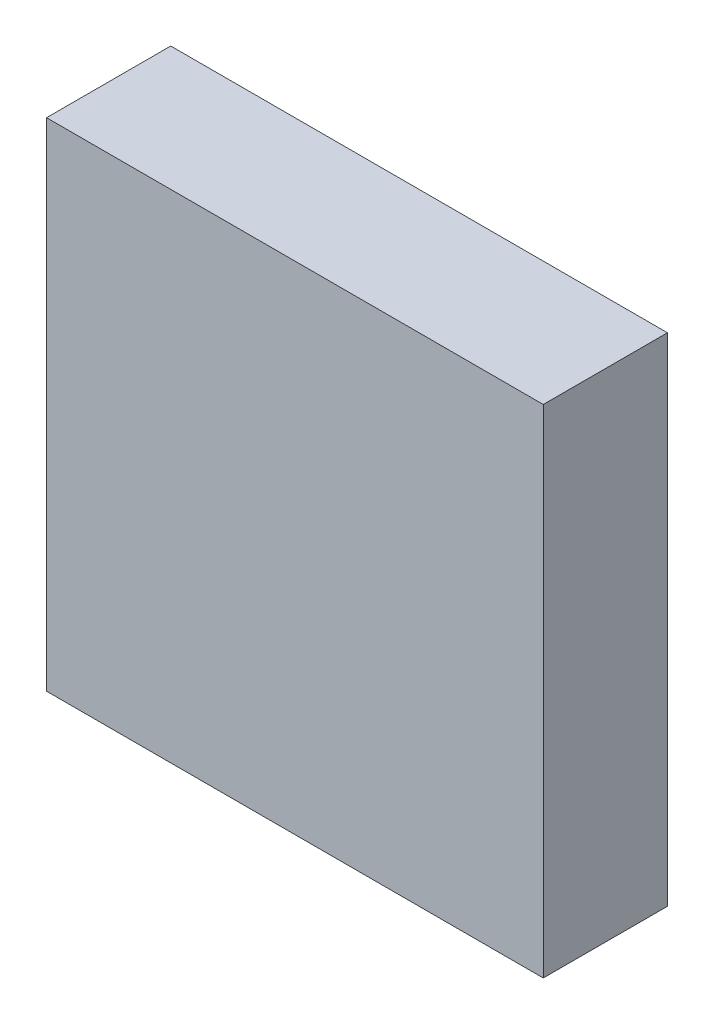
ISO-10303-21;
HEADER;
FILE_DESCRIPTION(('STEP AP214'),'2;1');
FILE_NAME('part.step','',(''),(''),'','','');
FILE_SCHEMA(('AUTOMOTIVE_DESIGN { 1 0 10303 214 1 1 1 1 }'));
ENDSEC;
DATA;
#1=APPLICATION_CONTEXT('core data for automotive mechanical design processes');
#2=APPLICATION_PROTOCOL_DEFINITION('international standard','automotive_design',2000,#1);
#3=PRODUCT_CONTEXT('',#1,'mechanical');
#4=PRODUCT('Part','Part','',(#3));
#5=PRODUCT_RELATED_PRODUCT_CATEGORY('part','',(#4));
#6=PRODUCT_DEFINITION_FORMATION('','',#4);
#7=PRODUCT_DEFINITION_CONTEXT('part definition',#1,'design');
#8=PRODUCT_DEFINITION('design','',#6,#7);
#9=PRODUCT_DEFINITION_SHAPE('','',#8);
#10=(LENGTH_UNIT() NAMED_UNIT(*) SI_UNIT(.MILLI.,.METRE.));
#11=(NAMED_UNIT(*) PLANE_ANGLE_UNIT() SI_UNIT($,.RADIAN.));
#12=(NAMED_UNIT(*) SI_UNIT($,.STERADIAN.) SOLID_ANGLE_UNIT());
#13=UNCERTAINTY_MEASURE_WITH_UNIT(LENGTH_MEASURE(1.E-05),#10,'distance_accuracy_value','');
#14=(GEOMETRIC_REPRESENTATION_CONTEXT(3) GLOBAL_UNCERTAINTY_ASSIGNED_CONTEXT((#13)) GLOBAL_UNIT_ASSIGNED_CONTEXT((#10,
#11,#12)) REPRESENTATION_CONTEXT('',''));
#15=CARTESIAN_POINT('',(0.,0.,0.));
#16=DIRECTION('',(0.,0.,1.));
#17=DIRECTION('',(1.,0.,0.));
#18=AXIS2_PLACEMENT_3D('',#15,#16,#17);
#19=CARTESIAN_POINT('',(-216.479833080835,582.885057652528,200.));
#20=DIRECTION('',(1.,0.,0.));
#21=DIRECTION('',(0.,0.,-1.));
#22=AXIS2_PLACEMENT_3D('',#19,#20,#21);
#23=PLANE('',#22);
#24=DIRECTION('',(0.,-1.,0.));
#25=VECTOR('',#24,1.);
#26=CARTESIAN_POINT('',(-216.479833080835,582.885057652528,0.));
#27=LINE('',#26,#25);
#28=CARTESIAN_POINT('',(-216.479833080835,582.885057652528,0.));
#29=VERTEX_POINT('',#28);
#30=CARTESIAN_POINT('',(-216.479833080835,-217.114942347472,0.));
#31=VERTEX_POINT('',#30);
#32=EDGE_CURVE('E96',#29,#31,#27,.T.);
#33=ORIENTED_EDGE('',*,*,#32,.T.);
#34=DIRECTION('',(0.,0.,-1.));
#35=VECTOR('',#34,1.);
#36=CARTESIAN_POINT('',(-216.479833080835,-217.114942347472,200.));
#37=LINE('',#36,#35);
#38=CARTESIAN_POINT('',(-216.479833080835,-217.114942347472,200.));
#39=VERTEX_POINT('',#38);
#40=EDGE_CURVE('E11',#39,#31,#37,.T.);
#41=ORIENTED_EDGE('',*,*,#40,.F.);
#42=DIRECTION('',(0.,-1.,0.));
#43=VECTOR('',#42,1.);
#44=CARTESIAN_POINT('',(-216.479833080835,582.885057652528,200.));
#45=LINE('',#44,#43);
#46=CARTESIAN_POINT('',(-216.479833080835,582.885057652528,200.));
#47=VERTEX_POINT('',#46);
#48=EDGE_CURVE('E84',#47,#39,#45,.T.);
#49=ORIENTED_EDGE('',*,*,#48,.F.);
#50=DIRECTION('',(0.,0.,-1.));
#51=VECTOR('',#50,1.);
#52=CARTESIAN_POINT('',(-216.479833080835,582.885057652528,200.));
#53=LINE('',#52,#51);
#54=EDGE_CURVE('E92',#47,#29,#53,.T.);
#55=ORIENTED_EDGE('',*,*,#54,.T.);
#56=EDGE_LOOP('',(#33,#41,#49,#55));
#57=FACE_BOUND('',#56,.T.);
#58=ADVANCED_FACE('F33',(#57),#23,.F.);
#59=CARTESIAN_POINT('',(-216.479833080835,-217.114942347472,200.));
#60=DIRECTION('',(0.,1.,0.));
#61=DIRECTION('',(0.,0.,1.));
#62=AXIS2_PLACEMENT_3D('',#59,#60,#61);
#63=PLANE('',#62);
#64=DIRECTION('',(1.,0.,0.));
#65=VECTOR('',#64,1.);
#66=CARTESIAN_POINT('',(-216.479833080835,-217.114942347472,0.));
#67=LINE('',#66,#65);
#68=CARTESIAN_POINT('',(583.520166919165,-217.114942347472,0.));
#69=VERTEX_POINT('',#68);
#70=EDGE_CURVE('E88',#31,#69,#67,.T.);
#71=ORIENTED_EDGE('',*,*,#70,.T.);
#72=DIRECTION('',(0.,0.,-1.));
#73=VECTOR('',#72,1.);
#74=CARTESIAN_POINT('',(583.520166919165,-217.114942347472,200.));
#75=LINE('',#74,#73);
#76=CARTESIAN_POINT('',(583.520166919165,-217.114942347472,200.));
#77=VERTEX_POINT('',#76);
#78=EDGE_CURVE('E41',#77,#69,#75,.T.);
#79=ORIENTED_EDGE('',*,*,#78,.F.);
#80=DIRECTION('',(1.,0.,0.));
#81=VECTOR('',#80,1.);
#82=CARTESIAN_POINT('',(-216.479833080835,-217.114942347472,200.));
#83=LINE('',#82,#81);
#84=EDGE_CURVE('E79',#39,#77,#83,.T.);
#85=ORIENTED_EDGE('',*,*,#84,.F.);
#86=ORIENTED_EDGE('',*,*,#40,.T.);
#87=EDGE_LOOP('',(#71,#79,#85,#86));
#88=FACE_BOUND('',#87,.T.);
#89=ADVANCED_FACE('F87',(#88),#63,.F.);
#90=CARTESIAN_POINT('',(583.520166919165,582.885057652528,200.));
#91=DIRECTION('',(-1.,0.,0.));
#92=DIRECTION('',(0.,0.,1.));
#93=AXIS2_PLACEMENT_3D('',#90,#91,#92);
#94=PLANE('',#93);
#95=DIRECTION('',(0.,1.,0.));
#96=VECTOR('',#95,1.);
#97=CARTESIAN_POINT('',(583.520166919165,582.885057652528,0.));
#98=LINE('',#97,#96);
#99=CARTESIAN_POINT('',(583.520166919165,582.885057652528,0.));
#100=VERTEX_POINT('',#99);
#101=EDGE_CURVE('E66',#69,#100,#98,.T.);
#102=ORIENTED_EDGE('',*,*,#101,.T.);
#103=DIRECTION('',(0.,0.,-1.));
#104=VECTOR('',#103,1.);
#105=CARTESIAN_POINT('',(583.520166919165,582.885057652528,200.));
#106=LINE('',#105,#104);
#107=CARTESIAN_POINT('',(583.520166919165,582.885057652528,200.));
#108=VERTEX_POINT('',#107);
#109=EDGE_CURVE('E89',#108,#100,#106,.T.);
#110=ORIENTED_EDGE('',*,*,#109,.F.);
#111=DIRECTION('',(0.,1.,0.));
#112=VECTOR('',#111,1.);
#113=CARTESIAN_POINT('',(583.520166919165,582.885057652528,200.));
#114=LINE('',#113,#112);
#115=EDGE_CURVE('E82',#77,#108,#114,.T.);
#116=ORIENTED_EDGE('',*,*,#115,.F.);
#117=ORIENTED_EDGE('',*,*,#78,.T.);
#118=EDGE_LOOP('',(#102,#110,#116,#117));
#119=FACE_BOUND('',#118,.T.);
#120=ADVANCED_FACE('F90',(#119),#94,.F.);
#121=CARTESIAN_POINT('',(-216.479833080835,582.885057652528,200.));
#122=DIRECTION('',(0.,-1.,0.));
#123=DIRECTION('',(0.,0.,-1.));
#124=AXIS2_PLACEMENT_3D('',#121,#122,#123);
#125=PLANE('',#124);
#126=DIRECTION('',(-1.,0.,0.));
#127=VECTOR('',#126,1.);
#128=CARTESIAN_POINT('',(-216.479833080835,582.885057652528,0.));
#129=LINE('',#128,#127);
#130=EDGE_CURVE('E72',#100,#29,#129,.T.);
#131=ORIENTED_EDGE('',*,*,#130,.T.);
#132=ORIENTED_EDGE('',*,*,#54,.F.);
#133=DIRECTION('',(-1.,0.,0.));
#134=VECTOR('',#133,1.);
#135=CARTESIAN_POINT('',(-216.479833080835,582.885057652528,200.));
#136=LINE('',#135,#134);
#137=EDGE_CURVE('E49',#108,#47,#136,.T.);
#138=ORIENTED_EDGE('',*,*,#137,.F.);
#139=ORIENTED_EDGE('',*,*,#109,.T.);
#140=EDGE_LOOP('',(#131,#132,#138,#139));
#141=FACE_BOUND('',#140,.T.);
#142=ADVANCED_FACE('F103',(#141),#125,.F.);
#143=CARTESIAN_POINT('',(0.,0.,200.));
#144=DIRECTION('',(0.,0.,1.));
#145=DIRECTION('',(1.,0.,0.));
#146=AXIS2_PLACEMENT_3D('',#143,#144,#145);
#147=PLANE('',#146);
#148=ORIENTED_EDGE('',*,*,#48,.T.);
#149=ORIENTED_EDGE('',*,*,#84,.T.);
#150=ORIENTED_EDGE('',*,*,#115,.T.);
#151=ORIENTED_EDGE('',*,*,#137,.T.);
#152=EDGE_LOOP('',(#148,#149,#150,#151));
#153=FACE_BOUND('',#152,.T.);
#154=ADVANCED_FACE('F80',(#153),#147,.T.);
#155=CARTESIAN_POINT('',(0.,0.,0.));
#156=DIRECTION('',(0.,0.,1.));
#157=DIRECTION('',(1.,0.,0.));
#158=AXIS2_PLACEMENT_3D('',#155,#156,#157);
#159=PLANE('',#158);
#160=ORIENTED_EDGE('',*,*,#32,.F.);
#161=ORIENTED_EDGE('',*,*,#130,.F.);
#162=ORIENTED_EDGE('',*,*,#101,.F.);
#163=ORIENTED_EDGE('',*,*,#70,.F.);
#164=EDGE_LOOP('',(#160,#161,#162,#163));
#165=FACE_BOUND('',#164,.T.);
#166=ADVANCED_FACE('F106',(#165),#159,.F.);
#167=CLOSED_SHELL('',(#58,#89,#120,#142,#154,#166));
#168=MANIFOLD_SOLID_BREP('B2',#167);
#169=ADVANCED_BREP_SHAPE_REPRESENTATION('',(#18,#168),#14);
#170=SHAPE_DEFINITION_REPRESENTATION(#9,#169);
ENDSEC;
END-ISO-10303-21;
